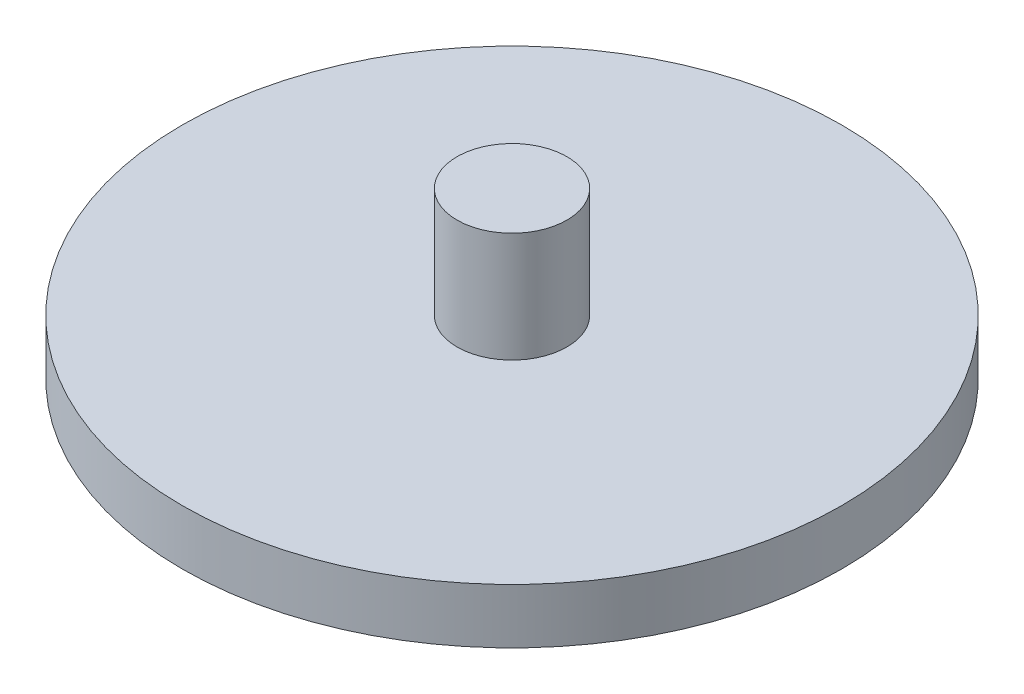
ISO-10303-21;
HEADER;
FILE_DESCRIPTION(('STEP AP214'),'2;1');
FILE_NAME('part.step','',(''),(''),'','','');
FILE_SCHEMA(('AUTOMOTIVE_DESIGN { 1 0 10303 214 1 1 1 1 }'));
ENDSEC;
DATA;
#1=APPLICATION_CONTEXT('core data for automotive mechanical design processes');
#2=APPLICATION_PROTOCOL_DEFINITION('international standard','automotive_design',2000,#1);
#3=PRODUCT_CONTEXT('',#1,'mechanical');
#4=PRODUCT('Part','Part','',(#3));
#5=PRODUCT_RELATED_PRODUCT_CATEGORY('part','',(#4));
#6=PRODUCT_DEFINITION_FORMATION('','',#4);
#7=PRODUCT_DEFINITION_CONTEXT('part definition',#1,'design');
#8=PRODUCT_DEFINITION('design','',#6,#7);
#9=PRODUCT_DEFINITION_SHAPE('','',#8);
#10=(LENGTH_UNIT() NAMED_UNIT(*) SI_UNIT(.MILLI.,.METRE.));
#11=(NAMED_UNIT(*) PLANE_ANGLE_UNIT() SI_UNIT($,.RADIAN.));
#12=(NAMED_UNIT(*) SI_UNIT($,.STERADIAN.) SOLID_ANGLE_UNIT());
#13=UNCERTAINTY_MEASURE_WITH_UNIT(LENGTH_MEASURE(1.E-05),#10,'distance_accuracy_value','');
#14=(GEOMETRIC_REPRESENTATION_CONTEXT(3) GLOBAL_UNCERTAINTY_ASSIGNED_CONTEXT((#13)) GLOBAL_UNIT_ASSIGNED_CONTEXT((#10,
#11,#12)) REPRESENTATION_CONTEXT('',''));
#15=CARTESIAN_POINT('',(0.,0.,0.));
#16=DIRECTION('',(0.,0.,1.));
#17=DIRECTION('',(1.,0.,0.));
#18=AXIS2_PLACEMENT_3D('',#15,#16,#17);
#19=CARTESIAN_POINT('',(0.,-25.4,0.));
#20=DIRECTION('',(0.,-1.,0.));
#21=DIRECTION('',(0.,0.,-1.));
#22=AXIS2_PLACEMENT_3D('',#19,#20,#21);
#23=PLANE('',#22);
#24=CARTESIAN_POINT('',(0.,-25.4,0.));
#25=DIRECTION('',(0.,-1.,0.));
#26=DIRECTION('',(0.,0.,-1.));
#27=AXIS2_PLACEMENT_3D('',#24,#25,#26);
#28=CIRCLE('',#27,152.4);
#29=CARTESIAN_POINT('',(0.,-25.4,-152.4));
#30=VERTEX_POINT('',#29);
#31=EDGE_CURVE('E132',#30,#30,#28,.T.);
#32=ORIENTED_EDGE('',*,*,#31,.T.);
#33=EDGE_LOOP('',(#32));
#34=FACE_BOUND('',#33,.T.);
#35=DIRECTION('',(1.,0.,0.));
#36=VECTOR('',#35,1.);
#37=CARTESIAN_POINT('',(0.,-25.4,27.94));
#38=LINE('',#37,#36);
#39=CARTESIAN_POINT('',(-63.5,-25.4,27.94));
#40=VERTEX_POINT('',#39);
#41=CARTESIAN_POINT('',(63.5,-25.4,27.94));
#42=VERTEX_POINT('',#41);
#43=EDGE_CURVE('E94',#40,#42,#38,.T.);
#44=ORIENTED_EDGE('',*,*,#43,.T.);
#45=DIRECTION('',(0.,0.,-1.));
#46=VECTOR('',#45,1.);
#47=CARTESIAN_POINT('',(63.5,-25.4,0.));
#48=LINE('',#47,#46);
#49=CARTESIAN_POINT('',(63.5,-25.4,-27.94));
#50=VERTEX_POINT('',#49);
#51=EDGE_CURVE('E57',#42,#50,#48,.T.);
#52=ORIENTED_EDGE('',*,*,#51,.T.);
#53=DIRECTION('',(1.,0.,0.));
#54=VECTOR('',#53,1.);
#55=CARTESIAN_POINT('',(0.,-25.4,-27.94));
#56=LINE('',#55,#54);
#57=CARTESIAN_POINT('',(-63.5,-25.4,-27.94));
#58=VERTEX_POINT('',#57);
#59=EDGE_CURVE('E122',#58,#50,#56,.T.);
#60=ORIENTED_EDGE('',*,*,#59,.F.);
#61=DIRECTION('',(0.,0.,1.));
#62=VECTOR('',#61,1.);
#63=CARTESIAN_POINT('',(-63.5,-25.4,0.));
#64=LINE('',#63,#62);
#65=EDGE_CURVE('E119',#58,#40,#64,.T.);
#66=ORIENTED_EDGE('',*,*,#65,.T.);
#67=EDGE_LOOP('',(#44,#52,#60,#66));
#68=FACE_BOUND('',#67,.T.);
#69=ADVANCED_FACE('F41',(#34,#68),#23,.T.);
#70=CARTESIAN_POINT('',(0.,50.8,0.));
#71=DIRECTION('',(0.,-1.,0.));
#72=DIRECTION('',(0.,0.,-1.));
#73=AXIS2_PLACEMENT_3D('',#70,#71,#72);
#74=CYLINDRICAL_SURFACE('',#73,25.4);
#75=CARTESIAN_POINT('',(0.,50.8,0.));
#76=DIRECTION('',(0.,1.,0.));
#77=DIRECTION('',(0.,0.,1.));
#78=AXIS2_PLACEMENT_3D('',#75,#76,#77);
#79=CIRCLE('',#78,25.4);
#80=CARTESIAN_POINT('',(0.,50.8,25.4));
#81=VERTEX_POINT('',#80);
#82=EDGE_CURVE('E11',#81,#81,#79,.T.);
#83=ORIENTED_EDGE('',*,*,#82,.F.);
#84=EDGE_LOOP('',(#83));
#85=FACE_BOUND('',#84,.T.);
#86=CARTESIAN_POINT('',(0.,0.,0.));
#87=DIRECTION('',(0.,1.,0.));
#88=DIRECTION('',(0.,0.,1.));
#89=AXIS2_PLACEMENT_3D('',#86,#87,#88);
#90=CIRCLE('',#89,25.4);
#91=CARTESIAN_POINT('',(0.,0.,25.4));
#92=VERTEX_POINT('',#91);
#93=EDGE_CURVE('E45',#92,#92,#90,.T.);
#94=ORIENTED_EDGE('',*,*,#93,.T.);
#95=EDGE_LOOP('',(#94));
#96=FACE_BOUND('',#95,.T.);
#97=ADVANCED_FACE('F43',(#85,#96),#74,.T.);
#98=CARTESIAN_POINT('',(0.,50.8,0.));
#99=DIRECTION('',(0.,1.,0.));
#100=DIRECTION('',(0.,0.,1.));
#101=AXIS2_PLACEMENT_3D('',#98,#99,#100);
#102=PLANE('',#101);
#103=ORIENTED_EDGE('',*,*,#82,.T.);
#104=EDGE_LOOP('',(#103));
#105=FACE_BOUND('',#104,.T.);
#106=ADVANCED_FACE('F153',(#105),#102,.T.);
#107=CARTESIAN_POINT('',(0.,-25.4,0.));
#108=DIRECTION('',(0.,1.,0.));
#109=DIRECTION('',(0.,0.,1.));
#110=AXIS2_PLACEMENT_3D('',#107,#108,#109);
#111=CYLINDRICAL_SURFACE('',#110,152.4);
#112=ORIENTED_EDGE('',*,*,#31,.F.);
#113=EDGE_LOOP('',(#112));
#114=FACE_BOUND('',#113,.T.);
#115=CARTESIAN_POINT('',(0.,0.,0.));
#116=DIRECTION('',(0.,-1.,0.));
#117=DIRECTION('',(0.,0.,-1.));
#118=AXIS2_PLACEMENT_3D('',#115,#116,#117);
#119=CIRCLE('',#118,152.4);
#120=CARTESIAN_POINT('',(0.,0.,-152.4));
#121=VERTEX_POINT('',#120);
#122=EDGE_CURVE('E131',#121,#121,#119,.T.);
#123=ORIENTED_EDGE('',*,*,#122,.T.);
#124=EDGE_LOOP('',(#123));
#125=FACE_BOUND('',#124,.T.);
#126=ADVANCED_FACE('F140',(#114,#125),#111,.T.);
#127=CARTESIAN_POINT('',(0.,0.,0.));
#128=DIRECTION('',(0.,-1.,0.));
#129=DIRECTION('',(0.,0.,-1.));
#130=AXIS2_PLACEMENT_3D('',#127,#128,#129);
#131=PLANE('',#130);
#132=ORIENTED_EDGE('',*,*,#93,.F.);
#133=EDGE_LOOP('',(#132));
#134=FACE_BOUND('',#133,.T.);
#135=ORIENTED_EDGE('',*,*,#122,.F.);
#136=EDGE_LOOP('',(#135));
#137=FACE_BOUND('',#136,.T.);
#138=ADVANCED_FACE('F142',(#134,#137),#131,.F.);
#139=CARTESIAN_POINT('',(63.5,-81.28,0.));
#140=DIRECTION('',(1.,0.,0.));
#141=DIRECTION('',(0.,0.,-1.));
#142=AXIS2_PLACEMENT_3D('',#139,#140,#141);
#143=PLANE('',#142);
#144=CARTESIAN_POINT('',(63.5,-53.34,0.));
#145=DIRECTION('',(1.,0.,0.));
#146=DIRECTION('',(0.,0.,-1.));
#147=AXIS2_PLACEMENT_3D('',#144,#145,#146);
#148=CIRCLE('',#147,20.32);
#149=CARTESIAN_POINT('',(63.5,-53.34,-20.32));
#150=VERTEX_POINT('',#149);
#151=EDGE_CURVE('E116',#150,#150,#148,.T.);
#152=ORIENTED_EDGE('',*,*,#151,.F.);
#153=EDGE_LOOP('',(#152));
#154=FACE_BOUND('',#153,.T.);
#155=ORIENTED_EDGE('',*,*,#51,.F.);
#156=DIRECTION('',(0.,1.,0.));
#157=VECTOR('',#156,1.);
#158=CARTESIAN_POINT('',(63.5,-81.28,27.94));
#159=LINE('',#158,#157);
#160=CARTESIAN_POINT('',(63.5,-81.28,27.94));
#161=VERTEX_POINT('',#160);
#162=EDGE_CURVE('E84',#161,#42,#159,.T.);
#163=ORIENTED_EDGE('',*,*,#162,.F.);
#164=DIRECTION('',(0.,0.,-1.));
#165=VECTOR('',#164,1.);
#166=CARTESIAN_POINT('',(63.5,-81.28,0.));
#167=LINE('',#166,#165);
#168=CARTESIAN_POINT('',(63.5,-81.28,-27.94));
#169=VERTEX_POINT('',#168);
#170=EDGE_CURVE('E104',#161,#169,#167,.T.);
#171=ORIENTED_EDGE('',*,*,#170,.T.);
#172=DIRECTION('',(0.,1.,0.));
#173=VECTOR('',#172,1.);
#174=CARTESIAN_POINT('',(63.5,-81.28,-27.94));
#175=LINE('',#174,#173);
#176=EDGE_CURVE('E81',#169,#50,#175,.T.);
#177=ORIENTED_EDGE('',*,*,#176,.T.);
#178=EDGE_LOOP('',(#155,#163,#171,#177));
#179=FACE_BOUND('',#178,.T.);
#180=ADVANCED_FACE('F144',(#154,#179),#143,.T.);
#181=CARTESIAN_POINT('',(0.,-81.28,27.94));
#182=DIRECTION('',(0.,0.,1.));
#183=DIRECTION('',(1.,0.,0.));
#184=AXIS2_PLACEMENT_3D('',#181,#182,#183);
#185=PLANE('',#184);
#186=ORIENTED_EDGE('',*,*,#43,.F.);
#187=DIRECTION('',(0.,1.,0.));
#188=VECTOR('',#187,1.);
#189=CARTESIAN_POINT('',(-63.5,-81.28,27.94));
#190=LINE('',#189,#188);
#191=CARTESIAN_POINT('',(-63.5,-81.28,27.94));
#192=VERTEX_POINT('',#191);
#193=EDGE_CURVE('E89',#192,#40,#190,.T.);
#194=ORIENTED_EDGE('',*,*,#193,.F.);
#195=DIRECTION('',(1.,0.,0.));
#196=VECTOR('',#195,1.);
#197=CARTESIAN_POINT('',(0.,-81.28,27.94));
#198=LINE('',#197,#196);
#199=EDGE_CURVE('E92',#192,#161,#198,.T.);
#200=ORIENTED_EDGE('',*,*,#199,.T.);
#201=ORIENTED_EDGE('',*,*,#162,.T.);
#202=EDGE_LOOP('',(#186,#194,#200,#201));
#203=FACE_BOUND('',#202,.T.);
#204=ADVANCED_FACE('F91',(#203),#185,.T.);
#205=CARTESIAN_POINT('',(-63.5,-81.28,0.));
#206=DIRECTION('',(-1.,0.,0.));
#207=DIRECTION('',(0.,0.,1.));
#208=AXIS2_PLACEMENT_3D('',#205,#206,#207);
#209=PLANE('',#208);
#210=CARTESIAN_POINT('',(-63.5,-53.34,0.));
#211=DIRECTION('',(-1.,0.,0.));
#212=DIRECTION('',(0.,0.,1.));
#213=AXIS2_PLACEMENT_3D('',#210,#211,#212);
#214=CIRCLE('',#213,20.32);
#215=CARTESIAN_POINT('',(-63.5,-53.34,20.32));
#216=VERTEX_POINT('',#215);
#217=EDGE_CURVE('E187',#216,#216,#214,.T.);
#218=ORIENTED_EDGE('',*,*,#217,.F.);
#219=EDGE_LOOP('',(#218));
#220=FACE_BOUND('',#219,.T.);
#221=ORIENTED_EDGE('',*,*,#65,.F.);
#222=DIRECTION('',(0.,1.,0.));
#223=VECTOR('',#222,1.);
#224=CARTESIAN_POINT('',(-63.5,-81.28,-27.94));
#225=LINE('',#224,#223);
#226=CARTESIAN_POINT('',(-63.5,-81.28,-27.94));
#227=VERTEX_POINT('',#226);
#228=EDGE_CURVE('E100',#227,#58,#225,.T.);
#229=ORIENTED_EDGE('',*,*,#228,.F.);
#230=DIRECTION('',(0.,0.,1.));
#231=VECTOR('',#230,1.);
#232=CARTESIAN_POINT('',(-63.5,-81.28,0.));
#233=LINE('',#232,#231);
#234=EDGE_CURVE('E103',#227,#192,#233,.T.);
#235=ORIENTED_EDGE('',*,*,#234,.T.);
#236=ORIENTED_EDGE('',*,*,#193,.T.);
#237=EDGE_LOOP('',(#221,#229,#235,#236));
#238=FACE_BOUND('',#237,.T.);
#239=ADVANCED_FACE('F107',(#220,#238),#209,.T.);
#240=CARTESIAN_POINT('',(0.,-81.28,-27.94));
#241=DIRECTION('',(0.,0.,1.));
#242=DIRECTION('',(1.,0.,0.));
#243=AXIS2_PLACEMENT_3D('',#240,#241,#242);
#244=PLANE('',#243);
#245=ORIENTED_EDGE('',*,*,#59,.T.);
#246=ORIENTED_EDGE('',*,*,#176,.F.);
#247=DIRECTION('',(1.,0.,0.));
#248=VECTOR('',#247,1.);
#249=CARTESIAN_POINT('',(0.,-81.28,-27.94));
#250=LINE('',#249,#248);
#251=EDGE_CURVE('E66',#227,#169,#250,.T.);
#252=ORIENTED_EDGE('',*,*,#251,.F.);
#253=ORIENTED_EDGE('',*,*,#228,.T.);
#254=EDGE_LOOP('',(#245,#246,#252,#253));
#255=FACE_BOUND('',#254,.T.);
#256=ADVANCED_FACE('F170',(#255),#244,.F.);
#257=CARTESIAN_POINT('',(0.,-81.28,0.));
#258=DIRECTION('',(0.,-1.,0.));
#259=DIRECTION('',(0.,0.,-1.));
#260=AXIS2_PLACEMENT_3D('',#257,#258,#259);
#261=PLANE('',#260);
#262=ORIENTED_EDGE('',*,*,#170,.F.);
#263=ORIENTED_EDGE('',*,*,#199,.F.);
#264=ORIENTED_EDGE('',*,*,#234,.F.);
#265=ORIENTED_EDGE('',*,*,#251,.T.);
#266=EDGE_LOOP('',(#262,#263,#264,#265));
#267=FACE_BOUND('',#266,.T.);
#268=ADVANCED_FACE('F102',(#267),#261,.T.);
#269=CARTESIAN_POINT('',(152.4,-53.34,0.));
#270=DIRECTION('',(-1.,0.,0.));
#271=DIRECTION('',(0.,0.,1.));
#272=AXIS2_PLACEMENT_3D('',#269,#270,#271);
#273=CYLINDRICAL_SURFACE('',#272,20.32);
#274=ORIENTED_EDGE('',*,*,#151,.T.);
#275=EDGE_LOOP('',(#274));
#276=FACE_BOUND('',#275,.T.);
#277=ORIENTED_EDGE('',*,*,#217,.T.);
#278=EDGE_LOOP('',(#277));
#279=FACE_BOUND('',#278,.T.);
#280=ADVANCED_FACE('F177',(#276,#279),#273,.F.);
#281=CLOSED_SHELL('',(#69,#97,#106,#126,#138,#180,#204,#239,#256,#268,#280));
#282=MANIFOLD_SOLID_BREP('B2',#281);
#283=ADVANCED_BREP_SHAPE_REPRESENTATION('',(#18,#282),#14);
#284=SHAPE_DEFINITION_REPRESENTATION(#9,#283);
ENDSEC;
END-ISO-10303-21;
